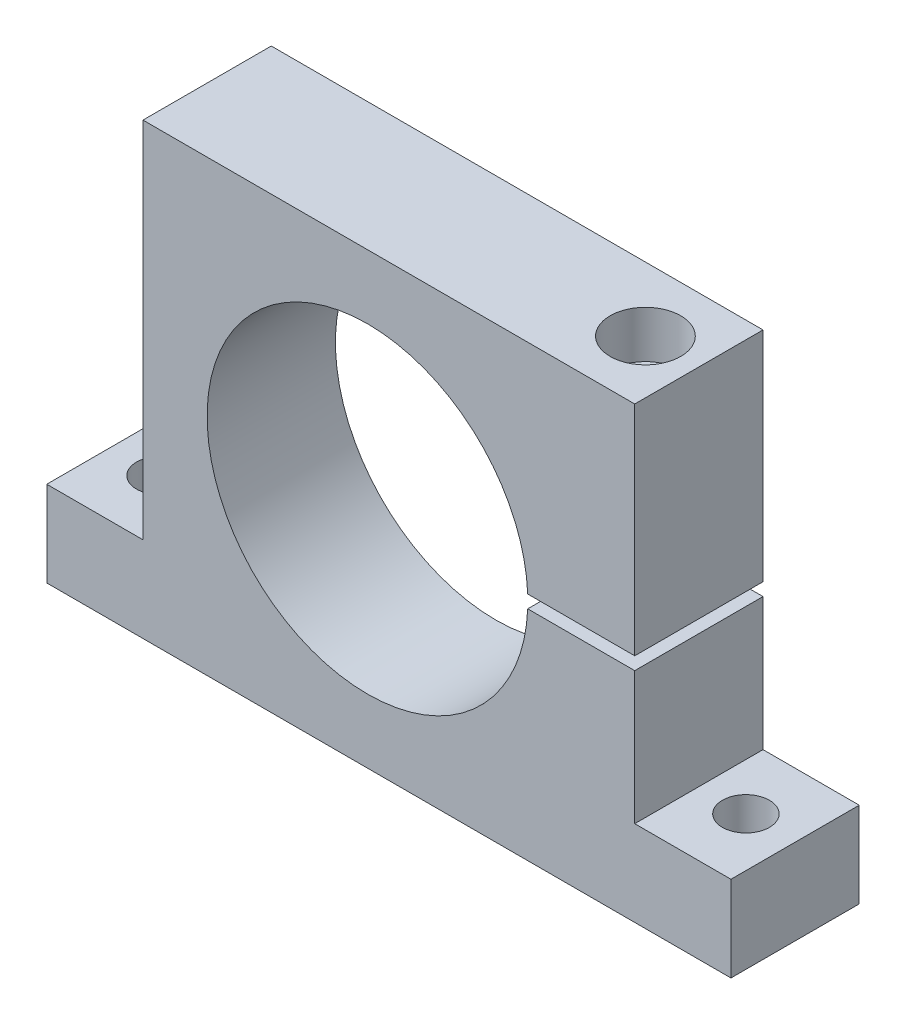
from build123d import *

# Parameters (mm, degrees)
BOSS_EXTRUDE1_DEPTH = 15
SKETCH2_R           = 5.5
CUT_EXTRUDE1_DEPTH  = 20


with BuildPart() as part:
    # Sketch1 → Boss-Extrude1 (new, symmetric)
    with BuildSketch(Plane.XY):
        with BuildLine():
            Line((-52.5, 52.5), (62.5, 52.5))
            Line((62.5, 52.5), (62.5, 1.5))
            Line((62.5, 1.5), (37.46998799, 1.5))
            ThreePointArc((37.46998799, 1.5), (-37.5, 0), (37.46998799, -1.5))
            Line((37.46998799, -1.5), (62.5, -1.5))
            Line((62.5, -1.5), (62.5, -32.5))
            Line((62.5, -32.5), (85, -32.5))
            Line((85, -32.5), (85, -52.5))
            Line((85, -52.5), (-75, -52.5))
            Line((-75, -52.5), (-75, -32.5))
            Line((-75, -32.5), (-52.5, -32.5))
            Line((-52.5, -32.5), (-52.5, 52.5))
        make_face()
    extrude(amount=BOSS_EXTRUDE1_DEPTH, both=True)

    # Sketch2 → Cut-Extrude1 (cut)
    with BuildSketch(Plane.XZ.offset(52.5)):
        with Locations((-63.5, 0)):
            Circle(SKETCH2_R)
        with Locations((73.5, 0)):
            Circle(SKETCH2_R)
    extrude(amount=-CUT_EXTRUDE1_DEPTH, mode=Mode.SUBTRACT)

    # Sketch3 → Cut-Revolve1 (revolve, cut)
    with BuildSketch(Plane.XY, mode=Mode.PRIVATE) as cut_revolve1_sk:
        Polygon((50, 52.5), (58.25, 52.5), (58.25, 41.5), (55, 41.5), (55, -37.5), (50, -40.504303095), align=None)
    revolve(cut_revolve1_sk.sketch.rotate(Axis((50, 52.5, 0), (0, -1, 0)), 90), axis=Axis((50, 52.5, 0), (0, -1, 0)), mode=Mode.SUBTRACT)


solid = part.part
